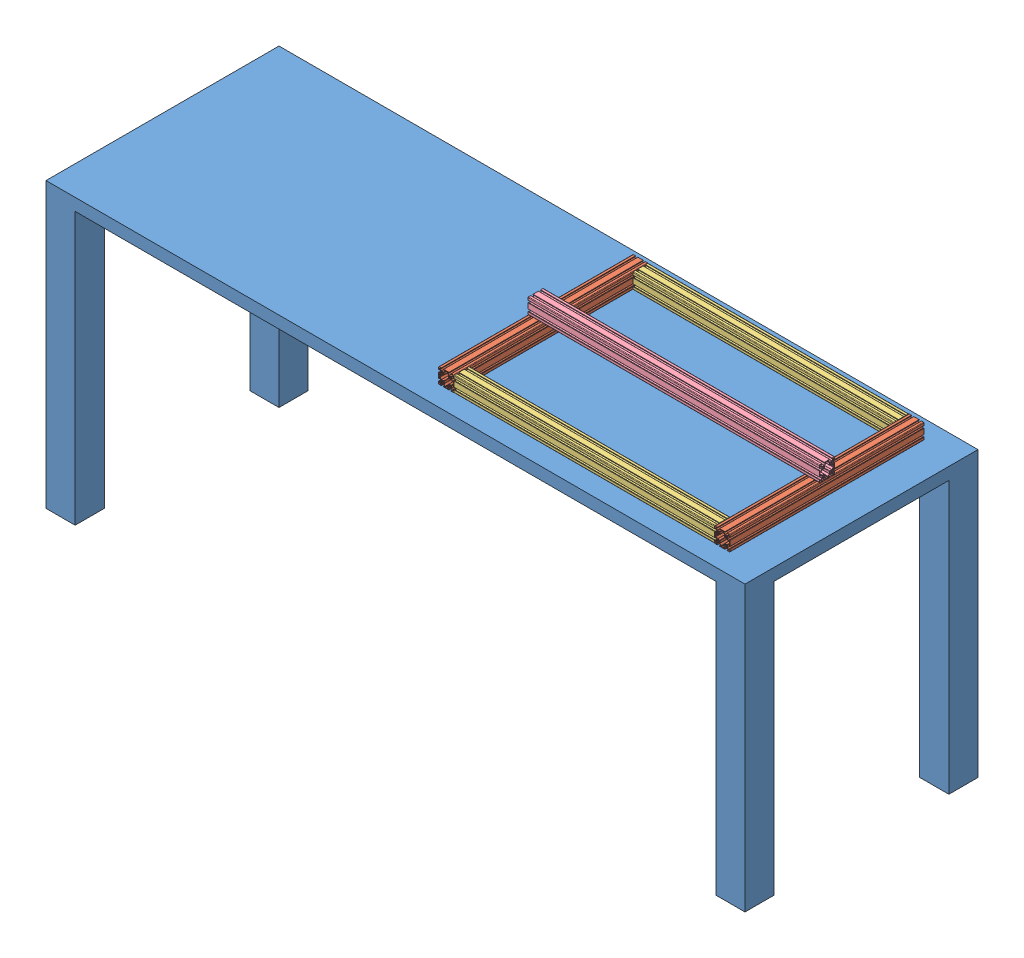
SolidWorks assembly Frame Assembly.SLDASM, configuration Default (file format 13000). Lengths in mm.
Overall size (1828.8 822.95 609.6).
6 component instances, 4 part files, 17 mates.
Components (placement in the parent):
- Capstone Table-1: Capstone Table.SLDPRT [Default] at (-814.5698 333.8526 2133.6) size (1828.8 742.95 609.6)
- 20in 4040-1: 20in 4040.SLDPRT [Default] at (204.7428 524.7272 1573.0717) size (40 40 508)
- 26.8in 4040-1: 26.8in 4040.SLDPRT [Default] at (882.3356 524.7272 1617.596) x (0 0 1) z (-1 0 0) size (40 40 682.12)
- 20in 4040-2: 20in 4040.SLDPRT [Default] at (926.8598 524.7272 1573.0717) size (40 40 508)
- 26.8in 4040-2: 26.8in 4040.SLDPRT [Default] at (200.2186 524.7272 2036.5474) x (0 0 -1) z (1 0 0) size (40 40 682.12)
- 30in 4040-1: 30in 4040.SLDPRT [Default] at (922.2186 450.1269 1687.9471) x (0 1 0) z (-1 0 0) size (40 40 762)
Mates (geometry in assembly coordinates):
- Coincident1: coincident anti-aligned: plane of Capstone Table-1 through (-814.5698 365.6026 2133.6) normal (0 1 0); plane of 20in 4040-1 through (173.3566 365.6026 2081.0717) normal (0 -1 0)
- Coincident5: coincident anti-aligned: plane of 20in 4040-1 through (200.2186 378.7406 2081.0717) normal (1 0 0); plane of 8020-20-4040 X 0_722 M-1 through (200.2186 371.4396 1580.6878) normal (-1 0 0)
- Coincident6: coincident aligned: plane of 20in 4040-1 through (187.0806 405.6026 2081.0717) normal (0 1 0); plane of 8020-20-4040 X 0_722 M-1 through (200.2186 405.6026 1599.9337) normal (0 1 0)
- Coincident7: coincident aligned: plane of 20in 4040-1 through (167.8346 371.4396 1573.0717) normal (0 0 -1); plane of 8020-20-4040 X 0_722 M-1 through (200.2186 392.4646 1573.0717) normal (0 0 -1)
- Coincident8: coincident aligned: plane of 8020-20-4040 X 0_722 M-1 through (200.2186 405.6026 1599.9337) normal (0 1 0); plane of 20in 4040-2 through (909.1976 405.6026 2081.0717) normal (0 1 0)
- Coincident12: coincident anti-aligned: plane of 8020-20-4040 X 0_722 M-1 through (882.3356 371.4396 1580.6878) normal (1 0 0); plane of 20in 4040-2 through (882.3356 392.4646 2081.0717) normal (-1 0 0)
- Coincident13: coincident aligned: plane of 8020-20-4040 X 0_722 M-1 through (200.2186 392.4646 1573.0717) normal (0 0 -1); plane of 20in 4040-2 through (889.9516 371.4396 1573.0717) normal (0 0 -1)
- Coincident15: coincident anti-aligned: plane of 20in 4040-1 through (200.2186 378.7406 2081.0717) normal (1 0 0); plane of 8020-20-4040 X 0_722 M-2 through (200.2186 371.4396 2073.4556) normal (-1 0 0)
- Coincident16: coincident anti-aligned: plane of 20in 4040-2 through (882.3356 392.4646 2081.0717) normal (-1 0 0); plane of 8020-20-4040 X 0_722 M-2 through (882.3356 371.4396 2073.4556) normal (1 0 0)
- Coincident17: coincident aligned: plane of 20in 4040-1 through (167.8346 371.4396 2081.0717) normal (0 0 1); plane of 20in 4040-2 through (889.9516 371.4396 2081.0717) normal (0 0 1)
- Coincident18: coincident aligned: plane of 20in 4040-2 through (909.1976 405.6026 2081.0717) normal (0 1 0); plane of 8020-20-4040 X 0_722 M-2 through (882.3356 405.6026 2054.2097) normal (0 1 0)
- Coincident19: coincident aligned: plane of 20in 4040-2 through (889.9516 371.4396 2081.0717) normal (0 0 1); plane of 8020-20-4040 X 0_722 M-2 through (882.3356 392.4646 2081.0717) normal (0 0 1)
- Distance1: distance = 50.8 mm: line of 8020-20-4040 X 0_722 M-1 through (200.2186 378.7406 1573.0717) axis (1 0 0); line of Capstone Table-1 through (1014.2302 365.6026 1524) axis (-1 0 0)
- Distance2: distance = 101.6 mm: line of 20in 4040-2 through (920.8356 405.6026 2081.0717) axis (0 0 -1); line of Capstone Table-1 through (1014.2302 365.6026 2133.6) axis (0 0 -1)
- Coincident20: coincident aligned: plane of 20in 4040-1 through (160.2186 392.4646 2081.0717) normal (-1 0 0); plane of 30in 4040-1 through (160.2186 413.2187 1841.2347) normal (-1 0 0)
- Coincident21: coincident anti-aligned: plane of 20in 4040-2 through (909.1976 405.6026 2081.0717) normal (0 1 0); plane of 30in 4040-1 through (160.2186 405.6026 1820.2097) normal (0 -1 0)
- Width1: width anti-aligned: plane of 26.8in 4040-1 through (200.2186 378.7406 1613.0717) normal (0 0 1); plane of 30in 4040-1 through (882.3356 378.7406 2041.0717) normal (0 0 -1); plane of 26.8in 4040-2 through (160.2186 432.4646 1807.0717) normal (0 0 -1); plane of 30in 4040-1 through (160.2186 418.7406 1847.0717) normal (0 0 1)
